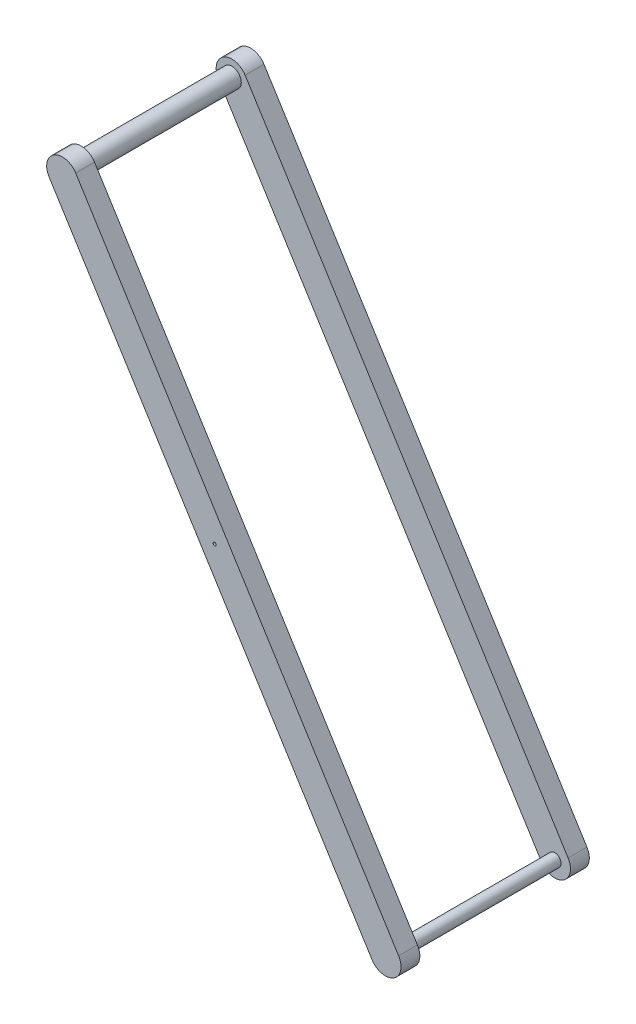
ISO-10303-21;
HEADER;
FILE_DESCRIPTION(('STEP AP214'),'2;1');
FILE_NAME('part.step','',(''),(''),'','','');
FILE_SCHEMA(('AUTOMOTIVE_DESIGN { 1 0 10303 214 1 1 1 1 }'));
ENDSEC;
DATA;
#1=APPLICATION_CONTEXT('core data for automotive mechanical design processes');
#2=APPLICATION_PROTOCOL_DEFINITION('international standard','automotive_design',2000,#1);
#3=PRODUCT_CONTEXT('',#1,'mechanical');
#4=PRODUCT('Part','Part','',(#3));
#5=PRODUCT_RELATED_PRODUCT_CATEGORY('part','',(#4));
#6=PRODUCT_DEFINITION_FORMATION('','',#4);
#7=PRODUCT_DEFINITION_CONTEXT('part definition',#1,'design');
#8=PRODUCT_DEFINITION('design','',#6,#7);
#9=PRODUCT_DEFINITION_SHAPE('','',#8);
#10=(LENGTH_UNIT() NAMED_UNIT(*) SI_UNIT(.MILLI.,.METRE.));
#11=(NAMED_UNIT(*) PLANE_ANGLE_UNIT() SI_UNIT($,.RADIAN.));
#12=(NAMED_UNIT(*) SI_UNIT($,.STERADIAN.) SOLID_ANGLE_UNIT());
#13=UNCERTAINTY_MEASURE_WITH_UNIT(LENGTH_MEASURE(1.E-05),#10,'distance_accuracy_value','');
#14=(GEOMETRIC_REPRESENTATION_CONTEXT(3) GLOBAL_UNCERTAINTY_ASSIGNED_CONTEXT((#13)) GLOBAL_UNIT_ASSIGNED_CONTEXT((#10,
#11,#12)) REPRESENTATION_CONTEXT('',''));
#15=CARTESIAN_POINT('',(0.,0.,0.));
#16=DIRECTION('',(0.,0.,1.));
#17=DIRECTION('',(1.,0.,0.));
#18=AXIS2_PLACEMENT_3D('',#15,#16,#17);
#19=CARTESIAN_POINT('',(0.,0.,90.));
#20=DIRECTION('',(0.,0.,-1.));
#21=DIRECTION('',(1.,0.,0.));
#22=AXIS2_PLACEMENT_3D('',#19,#20,#21);
#23=PLANE('',#22);
#24=CARTESIAN_POINT('',(0.,-250.452417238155,90.));
#25=DIRECTION('',(0.,0.,-1.));
#26=DIRECTION('',(-1.,0.,0.));
#27=AXIS2_PLACEMENT_3D('',#24,#25,#26);
#28=CIRCLE('',#27,1.5);
#29=CARTESIAN_POINT('',(-1.5,-250.452417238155,90.));
#30=VERTEX_POINT('',#29);
#31=EDGE_CURVE('E47',#30,#30,#28,.T.);
#32=ORIENTED_EDGE('',*,*,#31,.T.);
#33=EDGE_LOOP('',(#32));
#34=FACE_BOUND('',#33,.T.);
#35=CARTESIAN_POINT('',(-145.530185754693,-17.7182227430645,90.));
#36=DIRECTION('',(0.,0.,1.));
#37=DIRECTION('',(1.,0.,0.));
#38=AXIS2_PLACEMENT_3D('',#35,#36,#37);
#39=CIRCLE('',#38,15.);
#40=CARTESIAN_POINT('',(-158.248408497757,-25.6710090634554,90.));
#41=VERTEX_POINT('',#40);
#42=CARTESIAN_POINT('',(-153.482972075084,-5.,90.));
#43=VERTEX_POINT('',#42);
#44=EDGE_CURVE('E237',#41,#43,#39,.F.);
#45=ORIENTED_EDGE('',*,*,#44,.F.);
#46=DIRECTION('',(-0.530185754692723,0.847881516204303,0.));
#47=VECTOR('',#46,1.);
#48=CARTESIAN_POINT('',(-166.201194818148,-12.9527863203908,90.));
#49=LINE('',#48,#47);
#50=CARTESIAN_POINT('',(150.409573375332,-519.281777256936,90.));
#51=VERTEX_POINT('',#50);
#52=EDGE_CURVE('E205',#51,#41,#49,.T.);
#53=ORIENTED_EDGE('',*,*,#52,.F.);
#54=CARTESIAN_POINT('',(163.127796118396,-511.328990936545,90.));
#55=DIRECTION('',(0.,0.,1.));
#56=DIRECTION('',(1.,0.,0.));
#57=AXIS2_PLACEMENT_3D('',#54,#55,#56);
#58=CIRCLE('',#57,15.);
#59=CARTESIAN_POINT('',(171.080582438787,-524.047213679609,90.));
#60=VERTEX_POINT('',#59);
#61=EDGE_CURVE('E225',#60,#51,#58,.F.);
#62=ORIENTED_EDGE('',*,*,#61,.F.);
#63=CARTESIAN_POINT('',(163.127796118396,-511.328990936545,90.));
#64=DIRECTION('',(0.,0.,1.));
#65=DIRECTION('',(1.,0.,0.));
#66=AXIS2_PLACEMENT_3D('',#63,#64,#65);
#67=CIRCLE('',#66,15.);
#68=CARTESIAN_POINT('',(175.846018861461,-503.376204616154,90.));
#69=VERTEX_POINT('',#68);
#70=EDGE_CURVE('E222',#69,#60,#67,.F.);
#71=ORIENTED_EDGE('',*,*,#70,.F.);
#72=DIRECTION('',(0.530185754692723,-0.847881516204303,0.));
#73=VECTOR('',#72,1.);
#74=CARTESIAN_POINT('',(-140.764749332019,2.95278632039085,90.));
#75=LINE('',#74,#73);
#76=CARTESIAN_POINT('',(-132.811963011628,-9.7654364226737,90.));
#77=VERTEX_POINT('',#76);
#78=EDGE_CURVE('E202',#77,#69,#75,.T.);
#79=ORIENTED_EDGE('',*,*,#78,.F.);
#80=CARTESIAN_POINT('',(-145.530185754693,-17.7182227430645,90.));
#81=DIRECTION('',(0.,0.,1.));
#82=DIRECTION('',(1.,0.,0.));
#83=AXIS2_PLACEMENT_3D('',#80,#81,#82);
#84=CIRCLE('',#83,15.);
#85=EDGE_CURVE('E239',#43,#77,#84,.F.);
#86=ORIENTED_EDGE('',*,*,#85,.F.);
#87=EDGE_LOOP('',(#45,#53,#62,#71,#79,#86));
#88=FACE_BOUND('',#87,.T.);
#89=ADVANCED_FACE('F43',(#34,#88),#23,.F.);
#90=CARTESIAN_POINT('',(0.,0.,72.));
#91=DIRECTION('',(0.,0.,-1.));
#92=DIRECTION('',(1.,0.,0.));
#93=AXIS2_PLACEMENT_3D('',#90,#91,#92);
#94=PLANE('',#93);
#95=CARTESIAN_POINT('',(-145.530185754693,-17.7182227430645,72.));
#96=DIRECTION('',(0.,0.,-1.));
#97=DIRECTION('',(-1.,0.,0.));
#98=AXIS2_PLACEMENT_3D('',#95,#96,#97);
#99=CIRCLE('',#98,9.00000000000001);
#100=CARTESIAN_POINT('',(-154.530185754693,-17.7182227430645,72.));
#101=VERTEX_POINT('',#100);
#102=EDGE_CURVE('E12',#101,#101,#99,.T.);
#103=ORIENTED_EDGE('',*,*,#102,.F.);
#104=EDGE_LOOP('',(#103));
#105=FACE_BOUND('',#104,.T.);
#106=CARTESIAN_POINT('',(163.127796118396,-511.328990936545,72.));
#107=DIRECTION('',(0.,0.,-1.));
#108=DIRECTION('',(-1.,0.,0.));
#109=AXIS2_PLACEMENT_3D('',#106,#107,#108);
#110=CIRCLE('',#109,6.00000000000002);
#111=CARTESIAN_POINT('',(157.127796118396,-511.328990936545,72.));
#112=VERTEX_POINT('',#111);
#113=EDGE_CURVE('E242',#112,#112,#110,.T.);
#114=ORIENTED_EDGE('',*,*,#113,.F.);
#115=EDGE_LOOP('',(#114));
#116=FACE_BOUND('',#115,.T.);
#117=DIRECTION('',(0.530185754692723,-0.847881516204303,0.));
#118=VECTOR('',#117,1.);
#119=CARTESIAN_POINT('',(-140.764749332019,2.95278632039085,72.));
#120=LINE('',#119,#118);
#121=CARTESIAN_POINT('',(-132.811963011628,-9.7654364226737,72.));
#122=VERTEX_POINT('',#121);
#123=CARTESIAN_POINT('',(175.846018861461,-503.376204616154,72.));
#124=VERTEX_POINT('',#123);
#125=EDGE_CURVE('E209',#122,#124,#120,.T.);
#126=ORIENTED_EDGE('',*,*,#125,.T.);
#127=CARTESIAN_POINT('',(163.127796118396,-511.328990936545,72.));
#128=DIRECTION('',(0.,0.,1.));
#129=DIRECTION('',(1.,0.,0.));
#130=AXIS2_PLACEMENT_3D('',#127,#128,#129);
#131=CIRCLE('',#130,15.);
#132=CARTESIAN_POINT('',(171.080582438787,-524.047213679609,72.));
#133=VERTEX_POINT('',#132);
#134=EDGE_CURVE('E216',#133,#124,#131,.T.);
#135=ORIENTED_EDGE('',*,*,#134,.F.);
#136=CARTESIAN_POINT('',(163.127796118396,-511.328990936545,72.));
#137=DIRECTION('',(0.,0.,1.));
#138=DIRECTION('',(1.,0.,0.));
#139=AXIS2_PLACEMENT_3D('',#136,#137,#138);
#140=CIRCLE('',#139,15.);
#141=CARTESIAN_POINT('',(150.409573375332,-519.281777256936,72.));
#142=VERTEX_POINT('',#141);
#143=EDGE_CURVE('E219',#142,#133,#140,.T.);
#144=ORIENTED_EDGE('',*,*,#143,.F.);
#145=DIRECTION('',(-0.530185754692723,0.847881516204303,0.));
#146=VECTOR('',#145,1.);
#147=CARTESIAN_POINT('',(-166.201194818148,-12.9527863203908,72.));
#148=LINE('',#147,#146);
#149=CARTESIAN_POINT('',(-158.248408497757,-25.6710090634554,72.));
#150=VERTEX_POINT('',#149);
#151=EDGE_CURVE('E206',#142,#150,#148,.T.);
#152=ORIENTED_EDGE('',*,*,#151,.T.);
#153=CARTESIAN_POINT('',(-145.530185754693,-17.7182227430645,72.));
#154=DIRECTION('',(0.,0.,1.));
#155=DIRECTION('',(1.,0.,0.));
#156=AXIS2_PLACEMENT_3D('',#153,#154,#155);
#157=CIRCLE('',#156,15.);
#158=CARTESIAN_POINT('',(-153.482972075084,-5.,72.));
#159=VERTEX_POINT('',#158);
#160=EDGE_CURVE('E233',#159,#150,#157,.T.);
#161=ORIENTED_EDGE('',*,*,#160,.F.);
#162=CARTESIAN_POINT('',(-145.530185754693,-17.7182227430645,72.));
#163=DIRECTION('',(0.,0.,1.));
#164=DIRECTION('',(1.,0.,0.));
#165=AXIS2_PLACEMENT_3D('',#162,#163,#164);
#166=CIRCLE('',#165,15.);
#167=EDGE_CURVE('E235',#122,#159,#166,.T.);
#168=ORIENTED_EDGE('',*,*,#167,.F.);
#169=EDGE_LOOP('',(#126,#135,#144,#152,#161,#168));
#170=FACE_BOUND('',#169,.T.);
#171=ADVANCED_FACE('F268',(#105,#116,#170),#94,.T.);
#172=CARTESIAN_POINT('',(-140.764749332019,2.95278632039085,90.));
#173=DIRECTION('',(-0.847881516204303,-0.530185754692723,0.));
#174=DIRECTION('',(-0.530185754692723,0.847881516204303,0.));
#175=AXIS2_PLACEMENT_3D('',#172,#173,#174);
#176=PLANE('',#175);
#177=ORIENTED_EDGE('',*,*,#78,.T.);
#178=DIRECTION('',(0.,0.,-1.));
#179=VECTOR('',#178,1.);
#180=CARTESIAN_POINT('',(175.846018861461,-503.376204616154,90.));
#181=LINE('',#180,#179);
#182=EDGE_CURVE('E228',#124,#69,#181,.F.);
#183=ORIENTED_EDGE('',*,*,#182,.F.);
#184=ORIENTED_EDGE('',*,*,#125,.F.);
#185=DIRECTION('',(0.,0.,-1.));
#186=VECTOR('',#185,1.);
#187=CARTESIAN_POINT('',(-132.811963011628,-9.76543642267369,90.));
#188=LINE('',#187,#186);
#189=EDGE_CURVE('E230',#77,#122,#188,.T.);
#190=ORIENTED_EDGE('',*,*,#189,.F.);
#191=EDGE_LOOP('',(#177,#183,#184,#190));
#192=FACE_BOUND('',#191,.T.);
#193=ADVANCED_FACE('F274',(#192),#176,.F.);
#194=CARTESIAN_POINT('',(-166.201194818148,-12.9527863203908,90.));
#195=DIRECTION('',(0.847881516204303,0.530185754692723,0.));
#196=DIRECTION('',(0.530185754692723,-0.847881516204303,0.));
#197=AXIS2_PLACEMENT_3D('',#194,#195,#196);
#198=PLANE('',#197);
#199=ORIENTED_EDGE('',*,*,#151,.F.);
#200=DIRECTION('',(0.,0.,-1.));
#201=VECTOR('',#200,1.);
#202=CARTESIAN_POINT('',(150.409573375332,-519.281777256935,90.));
#203=LINE('',#202,#201);
#204=EDGE_CURVE('E208',#51,#142,#203,.T.);
#205=ORIENTED_EDGE('',*,*,#204,.F.);
#206=ORIENTED_EDGE('',*,*,#52,.T.);
#207=DIRECTION('',(0.,0.,-1.));
#208=VECTOR('',#207,1.);
#209=CARTESIAN_POINT('',(-158.248408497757,-25.6710090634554,90.));
#210=LINE('',#209,#208);
#211=EDGE_CURVE('E52',#150,#41,#210,.F.);
#212=ORIENTED_EDGE('',*,*,#211,.F.);
#213=EDGE_LOOP('',(#199,#205,#206,#212));
#214=FACE_BOUND('',#213,.T.);
#215=ADVANCED_FACE('F278',(#214),#198,.F.);
#216=CARTESIAN_POINT('',(163.127796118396,-511.328990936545,90.));
#217=DIRECTION('',(0.,0.,-1.));
#218=DIRECTION('',(1.,0.,0.));
#219=AXIS2_PLACEMENT_3D('',#216,#217,#218);
#220=CYLINDRICAL_SURFACE('',#219,15.);
#221=DIRECTION('',(0.,0.,-1.));
#222=VECTOR('',#221,1.);
#223=CARTESIAN_POINT('',(171.080582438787,-524.047213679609,90.));
#224=LINE('',#223,#222);
#225=EDGE_CURVE('E212',#60,#133,#224,.T.);
#226=ORIENTED_EDGE('',*,*,#225,.T.);
#227=ORIENTED_EDGE('',*,*,#134,.T.);
#228=ORIENTED_EDGE('',*,*,#182,.T.);
#229=ORIENTED_EDGE('',*,*,#70,.T.);
#230=EDGE_LOOP('',(#226,#227,#228,#229));
#231=FACE_BOUND('',#230,.T.);
#232=ADVANCED_FACE('F281',(#231),#220,.T.);
#233=CARTESIAN_POINT('',(163.127796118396,-511.328990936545,90.));
#234=DIRECTION('',(0.,0.,-1.));
#235=DIRECTION('',(1.,0.,0.));
#236=AXIS2_PLACEMENT_3D('',#233,#234,#235);
#237=CYLINDRICAL_SURFACE('',#236,15.);
#238=ORIENTED_EDGE('',*,*,#61,.T.);
#239=ORIENTED_EDGE('',*,*,#204,.T.);
#240=ORIENTED_EDGE('',*,*,#143,.T.);
#241=ORIENTED_EDGE('',*,*,#225,.F.);
#242=EDGE_LOOP('',(#238,#239,#240,#241));
#243=FACE_BOUND('',#242,.T.);
#244=ADVANCED_FACE('F286',(#243),#237,.T.);
#245=CARTESIAN_POINT('',(-145.530185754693,-17.7182227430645,90.));
#246=DIRECTION('',(0.,0.,-1.));
#247=DIRECTION('',(1.,0.,0.));
#248=AXIS2_PLACEMENT_3D('',#245,#246,#247);
#249=CYLINDRICAL_SURFACE('',#248,15.);
#250=DIRECTION('',(0.,0.,-1.));
#251=VECTOR('',#250,1.);
#252=CARTESIAN_POINT('',(-153.482972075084,-5.,90.));
#253=LINE('',#252,#251);
#254=EDGE_CURVE('E60',#43,#159,#253,.T.);
#255=ORIENTED_EDGE('',*,*,#254,.T.);
#256=ORIENTED_EDGE('',*,*,#160,.T.);
#257=ORIENTED_EDGE('',*,*,#211,.T.);
#258=ORIENTED_EDGE('',*,*,#44,.T.);
#259=EDGE_LOOP('',(#255,#256,#257,#258));
#260=FACE_BOUND('',#259,.T.);
#261=ADVANCED_FACE('F45',(#260),#249,.T.);
#262=CARTESIAN_POINT('',(-145.530185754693,-17.7182227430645,90.));
#263=DIRECTION('',(0.,0.,-1.));
#264=DIRECTION('',(1.,0.,0.));
#265=AXIS2_PLACEMENT_3D('',#262,#263,#264);
#266=CYLINDRICAL_SURFACE('',#265,15.);
#267=ORIENTED_EDGE('',*,*,#85,.T.);
#268=ORIENTED_EDGE('',*,*,#189,.T.);
#269=ORIENTED_EDGE('',*,*,#167,.T.);
#270=ORIENTED_EDGE('',*,*,#254,.F.);
#271=EDGE_LOOP('',(#267,#268,#269,#270));
#272=FACE_BOUND('',#271,.T.);
#273=ADVANCED_FACE('F254',(#272),#266,.T.);
#274=CARTESIAN_POINT('',(0.,-250.452417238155,67.7573593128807));
#275=DIRECTION('',(0.,0.,1.));
#276=DIRECTION('',(1.,0.,0.));
#277=AXIS2_PLACEMENT_3D('',#274,#275,#276);
#278=CYLINDRICAL_SURFACE('',#277,1.5);
#279=CARTESIAN_POINT('',(0.,-250.452417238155,78.));
#280=DIRECTION('',(0.,0.,-1.));
#281=DIRECTION('',(-1.,0.,0.));
#282=AXIS2_PLACEMENT_3D('',#279,#280,#281);
#283=CIRCLE('',#282,1.5);
#284=CARTESIAN_POINT('',(-1.5,-250.452417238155,78.));
#285=VERTEX_POINT('',#284);
#286=EDGE_CURVE('E199',#285,#285,#283,.F.);
#287=ORIENTED_EDGE('',*,*,#286,.F.);
#288=EDGE_LOOP('',(#287));
#289=FACE_BOUND('',#288,.T.);
#290=ORIENTED_EDGE('',*,*,#31,.F.);
#291=EDGE_LOOP('',(#290));
#292=FACE_BOUND('',#291,.T.);
#293=ADVANCED_FACE('F251',(#289,#292),#278,.F.);
#294=CARTESIAN_POINT('',(0.,0.,78.));
#295=DIRECTION('',(0.,0.,-1.));
#296=DIRECTION('',(1.,0.,0.));
#297=AXIS2_PLACEMENT_3D('',#294,#295,#296);
#298=PLANE('',#297);
#299=ORIENTED_EDGE('',*,*,#286,.T.);
#300=EDGE_LOOP('',(#299));
#301=FACE_BOUND('',#300,.T.);
#302=ADVANCED_FACE('F253',(#301),#298,.F.);
#303=CARTESIAN_POINT('',(0.,0.,-90.));
#304=DIRECTION('',(0.,0.,1.));
#305=DIRECTION('',(1.,0.,0.));
#306=AXIS2_PLACEMENT_3D('',#303,#304,#305);
#307=PLANE('',#306);
#308=CARTESIAN_POINT('',(0.,-250.452417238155,-90.));
#309=DIRECTION('',(0.,0.,-1.));
#310=DIRECTION('',(-1.,0.,0.));
#311=AXIS2_PLACEMENT_3D('',#308,#309,#310);
#312=CIRCLE('',#311,1.5);
#313=CARTESIAN_POINT('',(-1.5,-250.452417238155,-90.));
#314=VERTEX_POINT('',#313);
#315=EDGE_CURVE('E511',#314,#314,#312,.T.);
#316=ORIENTED_EDGE('',*,*,#315,.F.);
#317=EDGE_LOOP('',(#316));
#318=FACE_BOUND('',#317,.T.);
#319=CARTESIAN_POINT('',(-145.530185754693,-17.7182227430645,-90.));
#320=DIRECTION('',(0.,0.,1.));
#321=DIRECTION('',(1.,0.,0.));
#322=AXIS2_PLACEMENT_3D('',#319,#320,#321);
#323=CIRCLE('',#322,15.);
#324=CARTESIAN_POINT('',(-158.248408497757,-25.6710090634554,-90.));
#325=VERTEX_POINT('',#324);
#326=CARTESIAN_POINT('',(-153.482972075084,-5.,-90.));
#327=VERTEX_POINT('',#326);
#328=EDGE_CURVE('E185',#325,#327,#323,.F.);
#329=ORIENTED_EDGE('',*,*,#328,.T.);
#330=CARTESIAN_POINT('',(-145.530185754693,-17.7182227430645,-90.));
#331=DIRECTION('',(0.,0.,1.));
#332=DIRECTION('',(1.,0.,0.));
#333=AXIS2_PLACEMENT_3D('',#330,#331,#332);
#334=CIRCLE('',#333,15.);
#335=CARTESIAN_POINT('',(-132.811963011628,-9.7654364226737,-90.));
#336=VERTEX_POINT('',#335);
#337=EDGE_CURVE('E188',#327,#336,#334,.F.);
#338=ORIENTED_EDGE('',*,*,#337,.T.);
#339=DIRECTION('',(0.530185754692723,-0.847881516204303,0.));
#340=VECTOR('',#339,1.);
#341=CARTESIAN_POINT('',(-140.764749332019,2.95278632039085,-90.));
#342=LINE('',#341,#340);
#343=CARTESIAN_POINT('',(175.846018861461,-503.376204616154,-90.));
#344=VERTEX_POINT('',#343);
#345=EDGE_CURVE('E162',#336,#344,#342,.T.);
#346=ORIENTED_EDGE('',*,*,#345,.T.);
#347=CARTESIAN_POINT('',(163.127796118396,-511.328990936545,-90.));
#348=DIRECTION('',(0.,0.,1.));
#349=DIRECTION('',(1.,0.,0.));
#350=AXIS2_PLACEMENT_3D('',#347,#348,#349);
#351=CIRCLE('',#350,15.);
#352=CARTESIAN_POINT('',(171.080582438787,-524.047213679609,-90.));
#353=VERTEX_POINT('',#352);
#354=EDGE_CURVE('E155',#344,#353,#351,.F.);
#355=ORIENTED_EDGE('',*,*,#354,.T.);
#356=CARTESIAN_POINT('',(163.127796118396,-511.328990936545,-90.));
#357=DIRECTION('',(0.,0.,1.));
#358=DIRECTION('',(1.,0.,0.));
#359=AXIS2_PLACEMENT_3D('',#356,#357,#358);
#360=CIRCLE('',#359,15.);
#361=CARTESIAN_POINT('',(150.409573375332,-519.281777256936,-90.));
#362=VERTEX_POINT('',#361);
#363=EDGE_CURVE('E174',#353,#362,#360,.F.);
#364=ORIENTED_EDGE('',*,*,#363,.T.);
#365=DIRECTION('',(-0.530185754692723,0.847881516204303,0.));
#366=VECTOR('',#365,1.);
#367=CARTESIAN_POINT('',(-166.201194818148,-12.9527863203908,-90.));
#368=LINE('',#367,#366);
#369=EDGE_CURVE('E142',#362,#325,#368,.T.);
#370=ORIENTED_EDGE('',*,*,#369,.T.);
#371=EDGE_LOOP('',(#329,#338,#346,#355,#364,#370));
#372=FACE_BOUND('',#371,.T.);
#373=ADVANCED_FACE('F262',(#318,#372),#307,.F.);
#374=CARTESIAN_POINT('',(0.,0.,-72.));
#375=DIRECTION('',(0.,0.,1.));
#376=DIRECTION('',(1.,0.,0.));
#377=AXIS2_PLACEMENT_3D('',#374,#375,#376);
#378=PLANE('',#377);
#379=CARTESIAN_POINT('',(-145.530185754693,-17.7182227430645,-72.));
#380=DIRECTION('',(0.,0.,1.));
#381=DIRECTION('',(1.,0.,0.));
#382=AXIS2_PLACEMENT_3D('',#379,#380,#381);
#383=CIRCLE('',#382,9.00000000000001);
#384=CARTESIAN_POINT('',(-136.530185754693,-17.7182227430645,-72.));
#385=VERTEX_POINT('',#384);
#386=EDGE_CURVE('E193',#385,#385,#383,.T.);
#387=ORIENTED_EDGE('',*,*,#386,.F.);
#388=EDGE_LOOP('',(#387));
#389=FACE_BOUND('',#388,.T.);
#390=CARTESIAN_POINT('',(163.127796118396,-511.328990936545,-72.));
#391=DIRECTION('',(0.,0.,1.));
#392=DIRECTION('',(1.,0.,0.));
#393=AXIS2_PLACEMENT_3D('',#390,#391,#392);
#394=CIRCLE('',#393,6.00000000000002);
#395=CARTESIAN_POINT('',(169.127796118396,-511.328990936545,-72.));
#396=VERTEX_POINT('',#395);
#397=EDGE_CURVE('E195',#396,#396,#394,.T.);
#398=ORIENTED_EDGE('',*,*,#397,.F.);
#399=EDGE_LOOP('',(#398));
#400=FACE_BOUND('',#399,.T.);
#401=DIRECTION('',(0.530185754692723,-0.847881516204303,0.));
#402=VECTOR('',#401,1.);
#403=CARTESIAN_POINT('',(-140.764749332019,2.95278632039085,-72.));
#404=LINE('',#403,#402);
#405=CARTESIAN_POINT('',(-132.811963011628,-9.7654364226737,-72.));
#406=VERTEX_POINT('',#405);
#407=CARTESIAN_POINT('',(175.846018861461,-503.376204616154,-72.));
#408=VERTEX_POINT('',#407);
#409=EDGE_CURVE('E163',#406,#408,#404,.T.);
#410=ORIENTED_EDGE('',*,*,#409,.F.);
#411=CARTESIAN_POINT('',(-145.530185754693,-17.7182227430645,-72.));
#412=DIRECTION('',(0.,0.,1.));
#413=DIRECTION('',(1.,0.,0.));
#414=AXIS2_PLACEMENT_3D('',#411,#412,#413);
#415=CIRCLE('',#414,15.);
#416=CARTESIAN_POINT('',(-153.482972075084,-5.,-72.));
#417=VERTEX_POINT('',#416);
#418=EDGE_CURVE('E183',#406,#417,#415,.T.);
#419=ORIENTED_EDGE('',*,*,#418,.T.);
#420=CARTESIAN_POINT('',(-145.530185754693,-17.7182227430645,-72.));
#421=DIRECTION('',(0.,0.,1.));
#422=DIRECTION('',(1.,0.,0.));
#423=AXIS2_PLACEMENT_3D('',#420,#421,#422);
#424=CIRCLE('',#423,15.);
#425=CARTESIAN_POINT('',(-158.248408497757,-25.6710090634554,-72.));
#426=VERTEX_POINT('',#425);
#427=EDGE_CURVE('E161',#417,#426,#424,.T.);
#428=ORIENTED_EDGE('',*,*,#427,.T.);
#429=DIRECTION('',(-0.530185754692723,0.847881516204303,0.));
#430=VECTOR('',#429,1.);
#431=CARTESIAN_POINT('',(-166.201194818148,-12.9527863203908,-72.));
#432=LINE('',#431,#430);
#433=CARTESIAN_POINT('',(150.409573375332,-519.281777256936,-72.));
#434=VERTEX_POINT('',#433);
#435=EDGE_CURVE('E139',#434,#426,#432,.T.);
#436=ORIENTED_EDGE('',*,*,#435,.F.);
#437=CARTESIAN_POINT('',(163.127796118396,-511.328990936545,-72.));
#438=DIRECTION('',(0.,0.,1.));
#439=DIRECTION('',(1.,0.,0.));
#440=AXIS2_PLACEMENT_3D('',#437,#438,#439);
#441=CIRCLE('',#440,15.);
#442=CARTESIAN_POINT('',(171.080582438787,-524.047213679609,-72.));
#443=VERTEX_POINT('',#442);
#444=EDGE_CURVE('E149',#434,#443,#441,.T.);
#445=ORIENTED_EDGE('',*,*,#444,.T.);
#446=CARTESIAN_POINT('',(163.127796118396,-511.328990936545,-72.));
#447=DIRECTION('',(0.,0.,1.));
#448=DIRECTION('',(1.,0.,0.));
#449=AXIS2_PLACEMENT_3D('',#446,#447,#448);
#450=CIRCLE('',#449,15.);
#451=EDGE_CURVE('E146',#443,#408,#450,.T.);
#452=ORIENTED_EDGE('',*,*,#451,.T.);
#453=EDGE_LOOP('',(#410,#419,#428,#436,#445,#452));
#454=FACE_BOUND('',#453,.T.);
#455=ADVANCED_FACE('F158',(#389,#400,#454),#378,.T.);
#456=CARTESIAN_POINT('',(-140.764749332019,2.95278632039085,-90.));
#457=DIRECTION('',(-0.847881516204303,-0.530185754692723,0.));
#458=DIRECTION('',(-0.530185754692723,0.847881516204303,0.));
#459=AXIS2_PLACEMENT_3D('',#456,#457,#458);
#460=PLANE('',#459);
#461=ORIENTED_EDGE('',*,*,#345,.F.);
#462=DIRECTION('',(0.,0.,1.));
#463=VECTOR('',#462,1.);
#464=CARTESIAN_POINT('',(-132.811963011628,-9.76543642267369,-90.));
#465=LINE('',#464,#463);
#466=EDGE_CURVE('E178',#336,#406,#465,.T.);
#467=ORIENTED_EDGE('',*,*,#466,.T.);
#468=ORIENTED_EDGE('',*,*,#409,.T.);
#469=DIRECTION('',(0.,0.,1.));
#470=VECTOR('',#469,1.);
#471=CARTESIAN_POINT('',(175.846018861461,-503.376204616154,-90.));
#472=LINE('',#471,#470);
#473=EDGE_CURVE('E176',#408,#344,#472,.F.);
#474=ORIENTED_EDGE('',*,*,#473,.T.);
#475=EDGE_LOOP('',(#461,#467,#468,#474));
#476=FACE_BOUND('',#475,.T.);
#477=ADVANCED_FACE('F373',(#476),#460,.F.);
#478=CARTESIAN_POINT('',(-166.201194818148,-12.9527863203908,-90.));
#479=DIRECTION('',(0.847881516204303,0.530185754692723,0.));
#480=DIRECTION('',(0.530185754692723,-0.847881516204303,0.));
#481=AXIS2_PLACEMENT_3D('',#478,#479,#480);
#482=PLANE('',#481);
#483=ORIENTED_EDGE('',*,*,#435,.T.);
#484=DIRECTION('',(0.,0.,1.));
#485=VECTOR('',#484,1.);
#486=CARTESIAN_POINT('',(-158.248408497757,-25.6710090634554,-90.));
#487=LINE('',#486,#485);
#488=EDGE_CURVE('E191',#426,#325,#487,.F.);
#489=ORIENTED_EDGE('',*,*,#488,.T.);
#490=ORIENTED_EDGE('',*,*,#369,.F.);
#491=DIRECTION('',(0.,0.,1.));
#492=VECTOR('',#491,1.);
#493=CARTESIAN_POINT('',(150.409573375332,-519.281777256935,-90.));
#494=LINE('',#493,#492);
#495=EDGE_CURVE('E135',#362,#434,#494,.T.);
#496=ORIENTED_EDGE('',*,*,#495,.T.);
#497=EDGE_LOOP('',(#483,#489,#490,#496));
#498=FACE_BOUND('',#497,.T.);
#499=ADVANCED_FACE('F137',(#498),#482,.F.);
#500=CARTESIAN_POINT('',(163.127796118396,-511.328990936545,-90.));
#501=DIRECTION('',(0.,0.,1.));
#502=DIRECTION('',(1.,0.,0.));
#503=AXIS2_PLACEMENT_3D('',#500,#501,#502);
#504=CYLINDRICAL_SURFACE('',#503,15.);
#505=DIRECTION('',(0.,0.,1.));
#506=VECTOR('',#505,1.);
#507=CARTESIAN_POINT('',(171.080582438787,-524.047213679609,-90.));
#508=LINE('',#507,#506);
#509=EDGE_CURVE('E151',#353,#443,#508,.T.);
#510=ORIENTED_EDGE('',*,*,#509,.F.);
#511=ORIENTED_EDGE('',*,*,#354,.F.);
#512=ORIENTED_EDGE('',*,*,#473,.F.);
#513=ORIENTED_EDGE('',*,*,#451,.F.);
#514=EDGE_LOOP('',(#510,#511,#512,#513));
#515=FACE_BOUND('',#514,.T.);
#516=ADVANCED_FACE('F390',(#515),#504,.T.);
#517=CARTESIAN_POINT('',(163.127796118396,-511.328990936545,-90.));
#518=DIRECTION('',(0.,0.,1.));
#519=DIRECTION('',(1.,0.,0.));
#520=AXIS2_PLACEMENT_3D('',#517,#518,#519);
#521=CYLINDRICAL_SURFACE('',#520,15.);
#522=ORIENTED_EDGE('',*,*,#363,.F.);
#523=ORIENTED_EDGE('',*,*,#509,.T.);
#524=ORIENTED_EDGE('',*,*,#444,.F.);
#525=ORIENTED_EDGE('',*,*,#495,.F.);
#526=EDGE_LOOP('',(#522,#523,#524,#525));
#527=FACE_BOUND('',#526,.T.);
#528=ADVANCED_FACE('F150',(#527),#521,.T.);
#529=CARTESIAN_POINT('',(-145.530185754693,-17.7182227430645,-90.));
#530=DIRECTION('',(0.,0.,1.));
#531=DIRECTION('',(1.,0.,0.));
#532=AXIS2_PLACEMENT_3D('',#529,#530,#531);
#533=CYLINDRICAL_SURFACE('',#532,15.);
#534=DIRECTION('',(0.,0.,1.));
#535=VECTOR('',#534,1.);
#536=CARTESIAN_POINT('',(-153.482972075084,-5.,-90.));
#537=LINE('',#536,#535);
#538=EDGE_CURVE('E180',#327,#417,#537,.T.);
#539=ORIENTED_EDGE('',*,*,#538,.F.);
#540=ORIENTED_EDGE('',*,*,#328,.F.);
#541=ORIENTED_EDGE('',*,*,#488,.F.);
#542=ORIENTED_EDGE('',*,*,#427,.F.);
#543=EDGE_LOOP('',(#539,#540,#541,#542));
#544=FACE_BOUND('',#543,.T.);
#545=ADVANCED_FACE('F406',(#544),#533,.T.);
#546=CARTESIAN_POINT('',(-145.530185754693,-17.7182227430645,-90.));
#547=DIRECTION('',(0.,0.,1.));
#548=DIRECTION('',(1.,0.,0.));
#549=AXIS2_PLACEMENT_3D('',#546,#547,#548);
#550=CYLINDRICAL_SURFACE('',#549,15.);
#551=ORIENTED_EDGE('',*,*,#337,.F.);
#552=ORIENTED_EDGE('',*,*,#538,.T.);
#553=ORIENTED_EDGE('',*,*,#418,.F.);
#554=ORIENTED_EDGE('',*,*,#466,.F.);
#555=EDGE_LOOP('',(#551,#552,#553,#554));
#556=FACE_BOUND('',#555,.T.);
#557=ADVANCED_FACE('F414',(#556),#550,.T.);
#558=CARTESIAN_POINT('',(0.,-250.452417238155,-67.7573593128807));
#559=DIRECTION('',(0.,0.,-1.));
#560=DIRECTION('',(1.,0.,0.));
#561=AXIS2_PLACEMENT_3D('',#558,#559,#560);
#562=CYLINDRICAL_SURFACE('',#561,1.5);
#563=CARTESIAN_POINT('',(0.,-250.452417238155,-78.));
#564=DIRECTION('',(0.,0.,-1.));
#565=DIRECTION('',(-1.,0.,0.));
#566=AXIS2_PLACEMENT_3D('',#563,#564,#565);
#567=CIRCLE('',#566,1.5);
#568=CARTESIAN_POINT('',(-1.5,-250.452417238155,-78.));
#569=VERTEX_POINT('',#568);
#570=EDGE_CURVE('E198',#569,#569,#567,.F.);
#571=ORIENTED_EDGE('',*,*,#570,.T.);
#572=EDGE_LOOP('',(#571));
#573=FACE_BOUND('',#572,.T.);
#574=ORIENTED_EDGE('',*,*,#315,.T.);
#575=EDGE_LOOP('',(#574));
#576=FACE_BOUND('',#575,.T.);
#577=ADVANCED_FACE('F422',(#573,#576),#562,.F.);
#578=CARTESIAN_POINT('',(0.,0.,-78.));
#579=DIRECTION('',(0.,0.,1.));
#580=DIRECTION('',(1.,0.,0.));
#581=AXIS2_PLACEMENT_3D('',#578,#579,#580);
#582=PLANE('',#581);
#583=ORIENTED_EDGE('',*,*,#570,.F.);
#584=EDGE_LOOP('',(#583));
#585=FACE_BOUND('',#584,.T.);
#586=ADVANCED_FACE('F431',(#585),#582,.F.);
#587=CARTESIAN_POINT('',(-145.530185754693,-17.7182227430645,97.4558441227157));
#588=DIRECTION('',(0.,0.,-1.));
#589=DIRECTION('',(-1.,0.,0.));
#590=AXIS2_PLACEMENT_3D('',#587,#588,#589);
#591=CYLINDRICAL_SURFACE('',#590,9.00000000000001);
#592=ORIENTED_EDGE('',*,*,#102,.T.);
#593=EDGE_LOOP('',(#592));
#594=FACE_BOUND('',#593,.T.);
#595=ORIENTED_EDGE('',*,*,#386,.T.);
#596=EDGE_LOOP('',(#595));
#597=FACE_BOUND('',#596,.T.);
#598=ADVANCED_FACE('F440',(#594,#597),#591,.T.);
#599=CARTESIAN_POINT('',(163.127796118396,-511.328990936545,-108.970562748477));
#600=DIRECTION('',(0.,0.,1.));
#601=DIRECTION('',(1.,0.,0.));
#602=AXIS2_PLACEMENT_3D('',#599,#600,#601);
#603=CYLINDRICAL_SURFACE('',#602,6.00000000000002);
#604=ORIENTED_EDGE('',*,*,#113,.T.);
#605=EDGE_LOOP('',(#604));
#606=FACE_BOUND('',#605,.T.);
#607=ORIENTED_EDGE('',*,*,#397,.T.);
#608=EDGE_LOOP('',(#607));
#609=FACE_BOUND('',#608,.T.);
#610=ADVANCED_FACE('F449',(#606,#609),#603,.T.);
#611=CLOSED_SHELL('',(#89,#171,#193,#215,#232,#244,#261,#273,#293,#302,#373,#455,#477,#499,#516,
#528,#545,#557,#577,#586,#598,#610));
#612=MANIFOLD_SOLID_BREP('B2',#611);
#613=ADVANCED_BREP_SHAPE_REPRESENTATION('',(#18,#612),#14);
#614=SHAPE_DEFINITION_REPRESENTATION(#9,#613);
ENDSEC;
END-ISO-10303-21;
